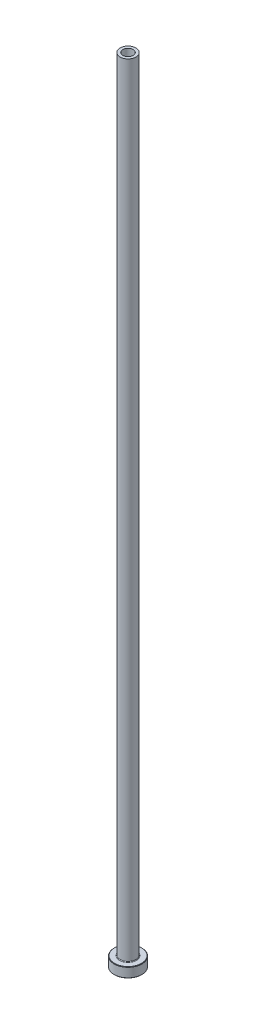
ISO-10303-21;
HEADER;
FILE_DESCRIPTION(('STEP AP214'),'2;1');
FILE_NAME('part.step','',(''),(''),'','','');
FILE_SCHEMA(('AUTOMOTIVE_DESIGN { 1 0 10303 214 1 1 1 1 }'));
ENDSEC;
DATA;
#1=APPLICATION_CONTEXT('core data for automotive mechanical design processes');
#2=APPLICATION_PROTOCOL_DEFINITION('international standard','automotive_design',2000,#1);
#3=PRODUCT_CONTEXT('',#1,'mechanical');
#4=PRODUCT('Part','Part','',(#3));
#5=PRODUCT_RELATED_PRODUCT_CATEGORY('part','',(#4));
#6=PRODUCT_DEFINITION_FORMATION('','',#4);
#7=PRODUCT_DEFINITION_CONTEXT('part definition',#1,'design');
#8=PRODUCT_DEFINITION('design','',#6,#7);
#9=PRODUCT_DEFINITION_SHAPE('','',#8);
#10=(LENGTH_UNIT() NAMED_UNIT(*) SI_UNIT(.MILLI.,.METRE.));
#11=(NAMED_UNIT(*) PLANE_ANGLE_UNIT() SI_UNIT($,.RADIAN.));
#12=(NAMED_UNIT(*) SI_UNIT($,.STERADIAN.) SOLID_ANGLE_UNIT());
#13=UNCERTAINTY_MEASURE_WITH_UNIT(LENGTH_MEASURE(1.E-05),#10,'distance_accuracy_value','');
#14=(GEOMETRIC_REPRESENTATION_CONTEXT(3) GLOBAL_UNCERTAINTY_ASSIGNED_CONTEXT((#13)) GLOBAL_UNIT_ASSIGNED_CONTEXT((#10,
#11,#12)) REPRESENTATION_CONTEXT('',''));
#15=CARTESIAN_POINT('',(0.,0.,0.));
#16=DIRECTION('',(0.,0.,1.));
#17=DIRECTION('',(1.,0.,0.));
#18=AXIS2_PLACEMENT_3D('',#15,#16,#17);
#19=CARTESIAN_POINT('',(0.,92.1876809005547,0.));
#20=DIRECTION('',(0.,1.,0.));
#21=DIRECTION('',(0.,0.,1.));
#22=AXIS2_PLACEMENT_3D('',#19,#20,#21);
#23=CYLINDRICAL_SURFACE('',#22,2.60000000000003);
#24=CARTESIAN_POINT('',(0.,400.,0.));
#25=DIRECTION('',(0.,1.,0.));
#26=DIRECTION('',(0.,0.,1.));
#27=AXIS2_PLACEMENT_3D('',#24,#25,#26);
#28=CIRCLE('',#27,2.60000000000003);
#29=CARTESIAN_POINT('',(0.,400.,2.60000000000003));
#30=VERTEX_POINT('',#29);
#31=EDGE_CURVE('E62',#30,#30,#28,.T.);
#32=ORIENTED_EDGE('',*,*,#31,.T.);
#33=EDGE_LOOP('',(#32));
#34=FACE_BOUND('',#33,.T.);
#35=CARTESIAN_POINT('',(0.,355.,0.));
#36=DIRECTION('',(0.,1.,0.));
#37=DIRECTION('',(0.,0.,1.));
#38=AXIS2_PLACEMENT_3D('',#35,#36,#37);
#39=CIRCLE('',#38,2.60000000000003);
#40=CARTESIAN_POINT('',(0.,355.,2.60000000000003));
#41=VERTEX_POINT('',#40);
#42=EDGE_CURVE('E71',#41,#41,#39,.T.);
#43=ORIENTED_EDGE('',*,*,#42,.F.);
#44=EDGE_LOOP('',(#43));
#45=FACE_BOUND('',#44,.T.);
#46=ADVANCED_FACE('F30',(#34,#45),#23,.F.);
#47=CARTESIAN_POINT('',(-2.60000000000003,400.,0.));
#48=DIRECTION('',(0.,1.,0.));
#49=DIRECTION('',(0.,0.,1.));
#50=AXIS2_PLACEMENT_3D('',#47,#48,#49);
#51=PLANE('',#50);
#52=CARTESIAN_POINT('',(0.,400.,0.));
#53=DIRECTION('',(0.,1.,0.));
#54=DIRECTION('',(0.,0.,1.));
#55=AXIS2_PLACEMENT_3D('',#52,#53,#54);
#56=CIRCLE('',#55,4.00000000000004);
#57=CARTESIAN_POINT('',(0.,400.,4.00000000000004));
#58=VERTEX_POINT('',#57);
#59=EDGE_CURVE('E65',#58,#58,#56,.T.);
#60=ORIENTED_EDGE('',*,*,#59,.T.);
#61=EDGE_LOOP('',(#60));
#62=FACE_BOUND('',#61,.T.);
#63=ORIENTED_EDGE('',*,*,#31,.F.);
#64=EDGE_LOOP('',(#63));
#65=FACE_BOUND('',#64,.T.);
#66=ADVANCED_FACE('F79',(#62,#65),#51,.T.);
#67=CARTESIAN_POINT('',(0.,92.1876809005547,0.));
#68=DIRECTION('',(0.,1.,0.));
#69=DIRECTION('',(0.,0.,1.));
#70=AXIS2_PLACEMENT_3D('',#67,#68,#69);
#71=CYLINDRICAL_SURFACE('',#70,4.00000000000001);
#72=CARTESIAN_POINT('',(0.,5.3,0.));
#73=DIRECTION('',(0.,1.,0.));
#74=DIRECTION('',(0.,0.,1.));
#75=AXIS2_PLACEMENT_3D('',#72,#73,#74);
#76=CIRCLE('',#75,4.00000000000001);
#77=CARTESIAN_POINT('',(0.,5.3,4.00000000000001));
#78=VERTEX_POINT('',#77);
#79=EDGE_CURVE('E59',#78,#78,#76,.T.);
#80=ORIENTED_EDGE('',*,*,#79,.T.);
#81=EDGE_LOOP('',(#80));
#82=FACE_BOUND('',#81,.T.);
#83=ORIENTED_EDGE('',*,*,#59,.F.);
#84=EDGE_LOOP('',(#83));
#85=FACE_BOUND('',#84,.T.);
#86=ADVANCED_FACE('F85',(#82,#85),#71,.T.);
#87=CARTESIAN_POINT('',(-3.99999999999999,5.,0.));
#88=DIRECTION('',(0.,1.,0.));
#89=DIRECTION('',(0.,0.,1.));
#90=AXIS2_PLACEMENT_3D('',#87,#88,#89);
#91=PLANE('',#90);
#92=CARTESIAN_POINT('',(0.,5.,0.));
#93=DIRECTION('',(0.,1.,0.));
#94=DIRECTION('',(0.,0.,1.));
#95=AXIS2_PLACEMENT_3D('',#92,#93,#94);
#96=CIRCLE('',#95,6.80000000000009);
#97=CARTESIAN_POINT('',(0.,5.,-6.80000000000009));
#98=VERTEX_POINT('',#97);
#99=EDGE_CURVE('E53',#98,#98,#96,.T.);
#100=ORIENTED_EDGE('',*,*,#99,.T.);
#101=EDGE_LOOP('',(#100));
#102=FACE_BOUND('',#101,.T.);
#103=CARTESIAN_POINT('',(0.,5.,0.));
#104=DIRECTION('',(0.,1.,0.));
#105=DIRECTION('',(0.,0.,1.));
#106=AXIS2_PLACEMENT_3D('',#103,#104,#105);
#107=CIRCLE('',#106,4.30000000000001);
#108=CARTESIAN_POINT('',(0.,5.,4.30000000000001));
#109=VERTEX_POINT('',#108);
#110=EDGE_CURVE('E56',#109,#109,#107,.F.);
#111=ORIENTED_EDGE('',*,*,#110,.T.);
#112=EDGE_LOOP('',(#111));
#113=FACE_BOUND('',#112,.T.);
#114=ADVANCED_FACE('F111',(#102,#113),#91,.T.);
#115=CARTESIAN_POINT('',(0.,92.1876809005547,0.));
#116=DIRECTION('',(0.,1.,0.));
#117=DIRECTION('',(0.,0.,1.));
#118=AXIS2_PLACEMENT_3D('',#115,#116,#117);
#119=CYLINDRICAL_SURFACE('',#118,6.99999999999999);
#120=CARTESIAN_POINT('',(0.,4.80000000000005,0.));
#121=DIRECTION('',(0.,1.,0.));
#122=DIRECTION('',(0.,0.,1.));
#123=AXIS2_PLACEMENT_3D('',#120,#121,#122);
#124=CIRCLE('',#123,6.99999999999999);
#125=CARTESIAN_POINT('',(0.,4.80000000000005,-6.99999999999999));
#126=VERTEX_POINT('',#125);
#127=EDGE_CURVE('E45',#126,#126,#124,.F.);
#128=ORIENTED_EDGE('',*,*,#127,.T.);
#129=EDGE_LOOP('',(#128));
#130=FACE_BOUND('',#129,.T.);
#131=CARTESIAN_POINT('',(0.,0.200000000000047,0.));
#132=DIRECTION('',(0.,-1.,0.));
#133=DIRECTION('',(0.,0.,-1.));
#134=AXIS2_PLACEMENT_3D('',#131,#132,#133);
#135=CIRCLE('',#134,6.99999999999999);
#136=CARTESIAN_POINT('',(0.,0.200000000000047,-6.99999999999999));
#137=VERTEX_POINT('',#136);
#138=EDGE_CURVE('E50',#137,#137,#135,.F.);
#139=ORIENTED_EDGE('',*,*,#138,.T.);
#140=EDGE_LOOP('',(#139));
#141=FACE_BOUND('',#140,.T.);
#142=ADVANCED_FACE('F108',(#130,#141),#119,.T.);
#143=CARTESIAN_POINT('',(-6.99999999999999,0.,0.));
#144=DIRECTION('',(0.,-1.,0.));
#145=DIRECTION('',(0.,0.,-1.));
#146=AXIS2_PLACEMENT_3D('',#143,#144,#145);
#147=PLANE('',#146);
#148=CARTESIAN_POINT('',(0.,0.,0.));
#149=DIRECTION('',(0.,-1.,0.));
#150=DIRECTION('',(0.,0.,-1.));
#151=AXIS2_PLACEMENT_3D('',#148,#149,#150);
#152=CIRCLE('',#151,3.35000000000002);
#153=CARTESIAN_POINT('',(0.,0.,-3.35000000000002));
#154=VERTEX_POINT('',#153);
#155=EDGE_CURVE('E37',#154,#154,#152,.F.);
#156=ORIENTED_EDGE('',*,*,#155,.T.);
#157=EDGE_LOOP('',(#156));
#158=FACE_BOUND('',#157,.T.);
#159=CARTESIAN_POINT('',(0.,0.,0.));
#160=DIRECTION('',(0.,-1.,0.));
#161=DIRECTION('',(0.,0.,-1.));
#162=AXIS2_PLACEMENT_3D('',#159,#160,#161);
#163=CIRCLE('',#162,6.79999999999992);
#164=CARTESIAN_POINT('',(0.,0.,-6.79999999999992));
#165=VERTEX_POINT('',#164);
#166=EDGE_CURVE('E41',#165,#165,#163,.T.);
#167=ORIENTED_EDGE('',*,*,#166,.T.);
#168=EDGE_LOOP('',(#167));
#169=FACE_BOUND('',#168,.T.);
#170=ADVANCED_FACE('F110',(#158,#169),#147,.T.);
#171=CARTESIAN_POINT('',(0.,92.1876809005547,0.));
#172=DIRECTION('',(0.,1.,0.));
#173=DIRECTION('',(0.,0.,1.));
#174=AXIS2_PLACEMENT_3D('',#171,#172,#173);
#175=CYLINDRICAL_SURFACE('',#174,2.85000000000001);
#176=CARTESIAN_POINT('',(0.,0.5,0.));
#177=DIRECTION('',(0.,-1.,0.));
#178=DIRECTION('',(0.,0.,-1.));
#179=AXIS2_PLACEMENT_3D('',#176,#177,#178);
#180=CIRCLE('',#179,2.85000000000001);
#181=CARTESIAN_POINT('',(0.,0.5,-2.85000000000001));
#182=VERTEX_POINT('',#181);
#183=EDGE_CURVE('E10',#182,#182,#180,.T.);
#184=ORIENTED_EDGE('',*,*,#183,.T.);
#185=EDGE_LOOP('',(#184));
#186=FACE_BOUND('',#185,.T.);
#187=CARTESIAN_POINT('',(0.,343.,0.));
#188=DIRECTION('',(0.,1.,0.));
#189=DIRECTION('',(0.,0.,1.));
#190=AXIS2_PLACEMENT_3D('',#187,#188,#189);
#191=CIRCLE('',#190,2.85000000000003);
#192=CARTESIAN_POINT('',(0.,343.,2.85000000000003));
#193=VERTEX_POINT('',#192);
#194=EDGE_CURVE('E68',#193,#193,#191,.T.);
#195=ORIENTED_EDGE('',*,*,#194,.T.);
#196=EDGE_LOOP('',(#195));
#197=FACE_BOUND('',#196,.T.);
#198=ADVANCED_FACE('F118',(#186,#197),#175,.F.);
#199=CARTESIAN_POINT('',(0.,343.,0.));
#200=DIRECTION('',(0.,-1.,0.));
#201=DIRECTION('',(0.,0.,-1.));
#202=AXIS2_PLACEMENT_3D('',#199,#200,#201);
#203=CONICAL_SURFACE('',#202,2.85000000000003,0.0208303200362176);
#204=ORIENTED_EDGE('',*,*,#42,.T.);
#205=EDGE_LOOP('',(#204));
#206=FACE_BOUND('',#205,.T.);
#207=ORIENTED_EDGE('',*,*,#194,.F.);
#208=EDGE_LOOP('',(#207));
#209=FACE_BOUND('',#208,.T.);
#210=ADVANCED_FACE('F75',(#206,#209),#203,.F.);
#211=CARTESIAN_POINT('',(0.,5.3,0.));
#212=DIRECTION('',(0.,1.,0.));
#213=DIRECTION('',(0.,0.,1.));
#214=AXIS2_PLACEMENT_3D('',#211,#212,#213);
#215=TOROIDAL_SURFACE('',#214,4.30000000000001,0.3);
#216=ORIENTED_EDGE('',*,*,#110,.F.);
#217=EDGE_LOOP('',(#216));
#218=FACE_BOUND('',#217,.T.);
#219=ORIENTED_EDGE('',*,*,#79,.F.);
#220=EDGE_LOOP('',(#219));
#221=FACE_BOUND('',#220,.T.);
#222=ADVANCED_FACE('F90',(#218,#221),#215,.F.);
#223=CARTESIAN_POINT('',(0.,5.,0.));
#224=DIRECTION('',(0.,-1.,0.));
#225=DIRECTION('',(0.,0.,-1.));
#226=AXIS2_PLACEMENT_3D('',#223,#224,#225);
#227=CONICAL_SURFACE('',#226,6.80000000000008,0.785398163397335);
#228=CARTESIAN_POINT('',(0.,4.80000000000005,-6.99999999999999));
#229=CARTESIAN_POINT('',(0.,4.80208333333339,-6.99791666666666));
#230=CARTESIAN_POINT('',(0.,4.80416666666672,-6.99583333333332));
#231=CARTESIAN_POINT('',(0.,4.80833333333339,-6.99166666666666));
#232=CARTESIAN_POINT('',(0.,4.81041666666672,-6.98958333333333));
#233=CARTESIAN_POINT('',(0.,4.81458333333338,-6.98541666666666));
#234=CARTESIAN_POINT('',(0.,4.81666666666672,-6.98333333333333));
#235=CARTESIAN_POINT('',(0.,4.82083333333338,-6.97916666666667));
#236=CARTESIAN_POINT('',(0.,4.82291666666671,-6.97708333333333));
#237=CARTESIAN_POINT('',(0.,4.82708333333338,-6.97291666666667));
#238=CARTESIAN_POINT('',(0.,4.82916666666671,-6.97083333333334));
#239=CARTESIAN_POINT('',(0.,4.83333333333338,-6.96666666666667));
#240=CARTESIAN_POINT('',(0.,4.83541666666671,-6.96458333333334));
#241=CARTESIAN_POINT('',(0.,4.83958333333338,-6.96041666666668));
#242=CARTESIAN_POINT('',(0.,4.84166666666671,-6.95833333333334));
#243=CARTESIAN_POINT('',(0.,4.84583333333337,-6.95416666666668));
#244=CARTESIAN_POINT('',(0.,4.84791666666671,-6.95208333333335));
#245=CARTESIAN_POINT('',(0.,4.85208333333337,-6.94791666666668));
#246=CARTESIAN_POINT('',(0.,4.85416666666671,-6.94583333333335));
#247=CARTESIAN_POINT('',(0.,4.85833333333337,-6.94166666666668));
#248=CARTESIAN_POINT('',(0.,4.8604166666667,-6.93958333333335));
#249=CARTESIAN_POINT('',(0.,4.86458333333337,-6.93541666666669));
#250=CARTESIAN_POINT('',(0.,4.8666666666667,-6.93333333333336));
#251=CARTESIAN_POINT('',(0.,4.87083333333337,-6.92916666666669));
#252=CARTESIAN_POINT('',(0.,4.8729166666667,-6.92708333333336));
#253=CARTESIAN_POINT('',(0.,4.87708333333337,-6.92291666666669));
#254=CARTESIAN_POINT('',(0.,4.8791666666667,-6.92083333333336));
#255=CARTESIAN_POINT('',(0.,4.88333333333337,-6.9166666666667));
#256=CARTESIAN_POINT('',(0.,4.8854166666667,-6.91458333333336));
#257=CARTESIAN_POINT('',(0.,4.88958333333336,-6.9104166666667));
#258=CARTESIAN_POINT('',(0.,4.8916666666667,-6.90833333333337));
#259=CARTESIAN_POINT('',(0.,4.89583333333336,-6.9041666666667));
#260=CARTESIAN_POINT('',(0.,4.89791666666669,-6.90208333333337));
#261=CARTESIAN_POINT('',(0.,4.90208333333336,-6.89791666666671));
#262=CARTESIAN_POINT('',(0.,4.90416666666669,-6.89583333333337));
#263=CARTESIAN_POINT('',(0.,4.90833333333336,-6.89166666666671));
#264=CARTESIAN_POINT('',(0.,4.91041666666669,-6.88958333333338));
#265=CARTESIAN_POINT('',(0.,4.91458333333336,-6.88541666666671));
#266=CARTESIAN_POINT('',(0.,4.91666666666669,-6.88333333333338));
#267=CARTESIAN_POINT('',(0.,4.92083333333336,-6.87916666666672));
#268=CARTESIAN_POINT('',(0.,4.92291666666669,-6.87708333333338));
#269=CARTESIAN_POINT('',(0.,4.92708333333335,-6.87291666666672));
#270=CARTESIAN_POINT('',(0.,4.92916666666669,-6.87083333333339));
#271=CARTESIAN_POINT('',(0.,4.93333333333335,-6.86666666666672));
#272=CARTESIAN_POINT('',(0.,4.93541666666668,-6.86458333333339));
#273=CARTESIAN_POINT('',(0.,4.93958333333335,-6.86041666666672));
#274=CARTESIAN_POINT('',(0.,4.94166666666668,-6.85833333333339));
#275=CARTESIAN_POINT('',(0.,4.94583333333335,-6.85416666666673));
#276=CARTESIAN_POINT('',(0.,4.94791666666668,-6.8520833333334));
#277=CARTESIAN_POINT('',(0.,4.95208333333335,-6.84791666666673));
#278=CARTESIAN_POINT('',(0.,4.95416666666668,-6.8458333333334));
#279=CARTESIAN_POINT('',(0.,4.95833333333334,-6.84166666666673));
#280=CARTESIAN_POINT('',(0.,4.96041666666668,-6.8395833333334));
#281=CARTESIAN_POINT('',(0.,4.96458333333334,-6.83541666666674));
#282=CARTESIAN_POINT('',(0.,4.96666666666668,-6.8333333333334));
#283=CARTESIAN_POINT('',(0.,4.97083333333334,-6.82916666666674));
#284=CARTESIAN_POINT('',(0.,4.97291666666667,-6.82708333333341));
#285=CARTESIAN_POINT('',(0.,4.97708333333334,-6.82291666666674));
#286=CARTESIAN_POINT('',(0.,4.97916666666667,-6.82083333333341));
#287=CARTESIAN_POINT('',(0.,4.98333333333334,-6.81666666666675));
#288=CARTESIAN_POINT('',(0.,4.98541666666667,-6.81458333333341));
#289=CARTESIAN_POINT('',(0.,4.98958333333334,-6.81041666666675));
#290=CARTESIAN_POINT('',(0.,4.99166666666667,-6.80833333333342));
#291=CARTESIAN_POINT('',(0.,4.99583333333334,-6.80416666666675));
#292=CARTESIAN_POINT('',(0.,4.99791666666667,-6.80208333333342));
#293=CARTESIAN_POINT('',(0.,5.,-6.80000000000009));
#294=B_SPLINE_CURVE_WITH_KNOTS('',3,(#228,#229,#230,#231,#232,#233,#234,#235,#236,#237,#238,
#239,#240,#241,#242,#243,#244,#245,#246,#247,#248,#249,#250,#251,#252,#253,#254,#255,#256,#257,
#258,#259,#260,#261,#262,#263,#264,#265,#266,#267,#268,#269,#270,#271,#272,#273,#274,#275,#276,
#277,#278,#279,#280,#281,#282,#283,#284,#285,#286,#287,#288,#289,#290,#291,#292,#293),
.UNSPECIFIED.,.F.,.F.,(4,2,2,2,2,2,2,2,2,2,2,2,2,2,2,2,2,2,2,2,2,2,2,2,2,2,2,2,2,2,2,2,4),(0.,
0.00883883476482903,0.0176776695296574,0.0265165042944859,0.0353553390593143,0.0441941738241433,
0.0530330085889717,0.0618718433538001,0.070710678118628,0.079549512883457,0.0883883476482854,
0.0972271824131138,0.106066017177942,0.114904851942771,0.1237436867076,0.132582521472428,
0.141421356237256,0.150260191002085,0.159099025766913,0.167937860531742,0.17677669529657,
0.185615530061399,0.194454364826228,0.203293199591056,0.212132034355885,0.220970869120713,
0.229809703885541,0.23864853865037,0.247487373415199,0.256326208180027,0.265165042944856,
0.274003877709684,0.282842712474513),.UNSPECIFIED.);
#295=EDGE_CURVE('BSEAM93',#126,#98,#294,.T.);
#296=ORIENTED_EDGE('',*,*,#127,.F.);
#297=ORIENTED_EDGE('',*,*,#99,.F.);
#298=ORIENTED_EDGE('',*,*,#295,.T.);
#299=ORIENTED_EDGE('',*,*,#295,.F.);
#300=EDGE_LOOP('',(#296,#298,#297,#299));
#301=FACE_BOUND('',#300,.T.);
#302=ADVANCED_FACE('F93',(#301),#227,.T.);
#303=CARTESIAN_POINT('',(0.,0.200000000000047,0.));
#304=DIRECTION('',(0.,1.,0.));
#305=DIRECTION('',(0.,0.,1.));
#306=AXIS2_PLACEMENT_3D('',#303,#304,#305);
#307=CONICAL_SURFACE('',#306,6.99999999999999,0.785398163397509);
#308=ORIENTED_EDGE('',*,*,#166,.F.);
#309=EDGE_LOOP('',(#308));
#310=FACE_BOUND('',#309,.T.);
#311=ORIENTED_EDGE('',*,*,#138,.F.);
#312=EDGE_LOOP('',(#311));
#313=FACE_BOUND('',#312,.T.);
#314=ADVANCED_FACE('F96',(#310,#313),#307,.T.);
#315=CARTESIAN_POINT('',(0.,0.,0.));
#316=DIRECTION('',(0.,-1.,0.));
#317=DIRECTION('',(0.,0.,-1.));
#318=AXIS2_PLACEMENT_3D('',#315,#316,#317);
#319=CONICAL_SURFACE('',#318,3.35000000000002,0.785398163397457);
#320=ORIENTED_EDGE('',*,*,#183,.F.);
#321=EDGE_LOOP('',(#320));
#322=FACE_BOUND('',#321,.T.);
#323=ORIENTED_EDGE('',*,*,#155,.F.);
#324=EDGE_LOOP('',(#323));
#325=FACE_BOUND('',#324,.T.);
#326=ADVANCED_FACE('F32',(#322,#325),#319,.F.);
#327=CLOSED_SHELL('',(#46,#66,#86,#114,#142,#170,#198,#210,#222,#302,#314,#326));
#328=MANIFOLD_SOLID_BREP('B2',#327);
#329=ADVANCED_BREP_SHAPE_REPRESENTATION('',(#18,#328),#14);
#330=SHAPE_DEFINITION_REPRESENTATION(#9,#329);
ENDSEC;
END-ISO-10303-21;
